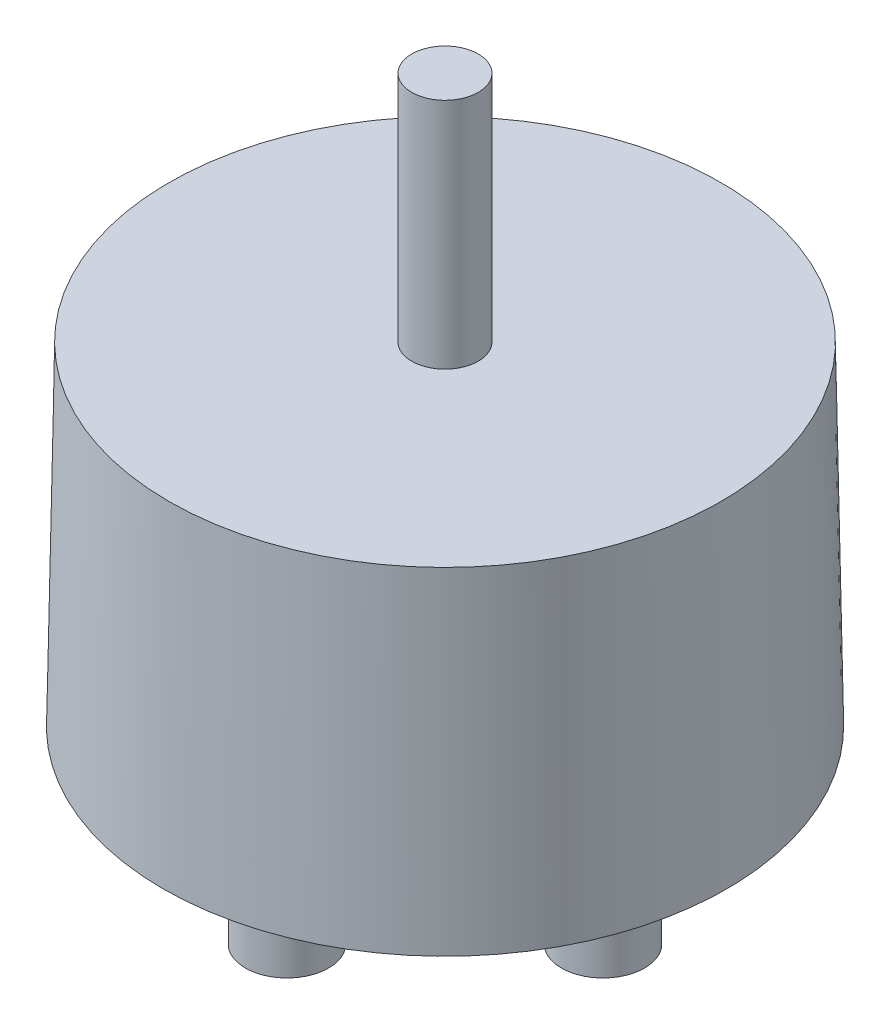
ISO-10303-21;
HEADER;
FILE_DESCRIPTION(('STEP AP214'),'2;1');
FILE_NAME('part.step','',(''),(''),'','','');
FILE_SCHEMA(('AUTOMOTIVE_DESIGN { 1 0 10303 214 1 1 1 1 }'));
ENDSEC;
DATA;
#1=APPLICATION_CONTEXT('core data for automotive mechanical design processes');
#2=APPLICATION_PROTOCOL_DEFINITION('international standard','automotive_design',2000,#1);
#3=PRODUCT_CONTEXT('',#1,'mechanical');
#4=PRODUCT('Part','Part','',(#3));
#5=PRODUCT_RELATED_PRODUCT_CATEGORY('part','',(#4));
#6=PRODUCT_DEFINITION_FORMATION('','',#4);
#7=PRODUCT_DEFINITION_CONTEXT('part definition',#1,'design');
#8=PRODUCT_DEFINITION('design','',#6,#7);
#9=PRODUCT_DEFINITION_SHAPE('','',#8);
#10=(LENGTH_UNIT() NAMED_UNIT(*) SI_UNIT(.MILLI.,.METRE.));
#11=(NAMED_UNIT(*) PLANE_ANGLE_UNIT() SI_UNIT($,.RADIAN.));
#12=(NAMED_UNIT(*) SI_UNIT($,.STERADIAN.) SOLID_ANGLE_UNIT());
#13=UNCERTAINTY_MEASURE_WITH_UNIT(LENGTH_MEASURE(1.E-05),#10,'distance_accuracy_value','');
#14=(GEOMETRIC_REPRESENTATION_CONTEXT(3) GLOBAL_UNCERTAINTY_ASSIGNED_CONTEXT((#13)) GLOBAL_UNIT_ASSIGNED_CONTEXT((#10,
#11,#12)) REPRESENTATION_CONTEXT('',''));
#15=CARTESIAN_POINT('',(0.,0.,0.));
#16=DIRECTION('',(0.,0.,1.));
#17=DIRECTION('',(1.,0.,0.));
#18=AXIS2_PLACEMENT_3D('',#15,#16,#17);
#19=CARTESIAN_POINT('',(-3.89473684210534,0.,8.64473684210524));
#20=DIRECTION('',(0.,-1.,0.));
#21=DIRECTION('',(0.,0.,-1.));
#22=AXIS2_PLACEMENT_3D('',#19,#20,#21);
#23=PLANE('',#22);
#24=CARTESIAN_POINT('',(0.,0.,9.5));
#25=DIRECTION('',(0.,1.,0.));
#26=DIRECTION('',(0.,0.,1.));
#27=AXIS2_PLACEMENT_3D('',#24,#25,#26);
#28=CIRCLE('',#27,1.5);
#29=CARTESIAN_POINT('',(0.,0.,11.));
#30=VERTEX_POINT('',#29);
#31=EDGE_CURVE('E195',#30,#30,#28,.T.);
#32=ORIENTED_EDGE('',*,*,#31,.T.);
#33=EDGE_LOOP('',(#32));
#34=FACE_BOUND('',#33,.T.);
#35=CARTESIAN_POINT('',(0.,0.,-9.5));
#36=DIRECTION('',(0.,1.,0.));
#37=DIRECTION('',(0.,0.,1.));
#38=AXIS2_PLACEMENT_3D('',#35,#36,#37);
#39=CIRCLE('',#38,1.5);
#40=CARTESIAN_POINT('',(0.,0.,-8.));
#41=VERTEX_POINT('',#40);
#42=EDGE_CURVE('E152',#41,#41,#39,.T.);
#43=ORIENTED_EDGE('',*,*,#42,.T.);
#44=EDGE_LOOP('',(#43));
#45=FACE_BOUND('',#44,.T.);
#46=CARTESIAN_POINT('',(-7.78947368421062,0.,7.78947368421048));
#47=DIRECTION('',(0.,-1.,0.));
#48=DIRECTION('',(0.,0.,-1.));
#49=AXIS2_PLACEMENT_3D('',#46,#47,#48);
#50=CIRCLE('',#49,5.96626230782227);
#51=CARTESIAN_POINT('',(-7.78947368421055,0.,1.82321137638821));
#52=VERTEX_POINT('',#51);
#53=CARTESIAN_POINT('',(-1.82321137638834,0.,7.78947368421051));
#54=VERTEX_POINT('',#53);
#55=EDGE_CURVE('E148',#52,#54,#50,.T.);
#56=ORIENTED_EDGE('',*,*,#55,.F.);
#57=CARTESIAN_POINT('',(-9.5,0.,0.));
#58=DIRECTION('',(0.,1.,0.));
#59=DIRECTION('',(0.,0.,1.));
#60=AXIS2_PLACEMENT_3D('',#57,#58,#59);
#61=CIRCLE('',#60,2.5);
#62=CARTESIAN_POINT('',(-7.78947368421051,0.,-1.82321137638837));
#63=VERTEX_POINT('',#62);
#64=EDGE_CURVE('E90',#63,#52,#61,.T.);
#65=ORIENTED_EDGE('',*,*,#64,.F.);
#66=CARTESIAN_POINT('',(-7.78947368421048,0.,-7.78947368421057));
#67=DIRECTION('',(0.,-1.,0.));
#68=DIRECTION('',(0.,0.,-1.));
#69=AXIS2_PLACEMENT_3D('',#66,#67,#68);
#70=CIRCLE('',#69,5.9662623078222);
#71=CARTESIAN_POINT('',(-1.82321137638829,0.,-7.78947368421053));
#72=VERTEX_POINT('',#71);
#73=EDGE_CURVE('E84',#72,#63,#70,.T.);
#74=ORIENTED_EDGE('',*,*,#73,.F.);
#75=CARTESIAN_POINT('',(0.,0.,-9.5));
#76=DIRECTION('',(0.,1.,0.));
#77=DIRECTION('',(0.,0.,1.));
#78=AXIS2_PLACEMENT_3D('',#75,#76,#77);
#79=CIRCLE('',#78,2.5);
#80=CARTESIAN_POINT('',(1.82321137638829,0.,-7.78947368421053));
#81=VERTEX_POINT('',#80);
#82=EDGE_CURVE('E159',#81,#72,#79,.T.);
#83=ORIENTED_EDGE('',*,*,#82,.F.);
#84=CARTESIAN_POINT('',(7.78947368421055,0.,-7.78947368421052));
#85=DIRECTION('',(0.,-1.,0.));
#86=DIRECTION('',(0.,0.,-1.));
#87=AXIS2_PLACEMENT_3D('',#84,#85,#86);
#88=CIRCLE('',#87,5.96626230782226);
#89=CARTESIAN_POINT('',(7.78947368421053,0.,-1.82321137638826));
#90=VERTEX_POINT('',#89);
#91=EDGE_CURVE('E120',#90,#81,#88,.T.);
#92=ORIENTED_EDGE('',*,*,#91,.F.);
#93=CARTESIAN_POINT('',(9.5,0.,0.));
#94=DIRECTION('',(0.,1.,0.));
#95=DIRECTION('',(0.,0.,1.));
#96=AXIS2_PLACEMENT_3D('',#93,#94,#95);
#97=CIRCLE('',#96,2.5);
#98=CARTESIAN_POINT('',(7.78947368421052,0.,1.82321137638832));
#99=VERTEX_POINT('',#98);
#100=EDGE_CURVE('E156',#99,#90,#97,.T.);
#101=ORIENTED_EDGE('',*,*,#100,.F.);
#102=CARTESIAN_POINT('',(7.78947368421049,0.,7.78947368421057));
#103=DIRECTION('',(0.,-1.,0.));
#104=DIRECTION('',(0.,0.,-1.));
#105=AXIS2_PLACEMENT_3D('',#102,#103,#104);
#106=CIRCLE('',#105,5.96626230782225);
#107=CARTESIAN_POINT('',(1.82321137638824,0.,7.78947368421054));
#108=VERTEX_POINT('',#107);
#109=EDGE_CURVE('E154',#108,#99,#106,.T.);
#110=ORIENTED_EDGE('',*,*,#109,.F.);
#111=CARTESIAN_POINT('',(0.,0.,9.5));
#112=DIRECTION('',(0.,1.,0.));
#113=DIRECTION('',(0.,0.,1.));
#114=AXIS2_PLACEMENT_3D('',#111,#112,#113);
#115=CIRCLE('',#114,2.5);
#116=EDGE_CURVE('E151',#54,#108,#115,.T.);
#117=ORIENTED_EDGE('',*,*,#116,.F.);
#118=EDGE_LOOP('',(#56,#65,#74,#83,#92,#101,#110,#117));
#119=FACE_BOUND('',#118,.T.);
#120=CARTESIAN_POINT('',(9.5,0.,0.));
#121=DIRECTION('',(0.,1.,0.));
#122=DIRECTION('',(0.,0.,1.));
#123=AXIS2_PLACEMENT_3D('',#120,#121,#122);
#124=CIRCLE('',#123,1.5);
#125=CARTESIAN_POINT('',(9.5,0.,1.50000000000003));
#126=VERTEX_POINT('',#125);
#127=EDGE_CURVE('E187',#126,#126,#124,.T.);
#128=ORIENTED_EDGE('',*,*,#127,.T.);
#129=EDGE_LOOP('',(#128));
#130=FACE_BOUND('',#129,.T.);
#131=CARTESIAN_POINT('',(-9.5,0.,0.));
#132=DIRECTION('',(0.,1.,0.));
#133=DIRECTION('',(0.,0.,1.));
#134=AXIS2_PLACEMENT_3D('',#131,#132,#133);
#135=CIRCLE('',#134,1.5);
#136=CARTESIAN_POINT('',(-9.5,0.,1.4999999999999));
#137=VERTEX_POINT('',#136);
#138=EDGE_CURVE('E191',#137,#137,#135,.T.);
#139=ORIENTED_EDGE('',*,*,#138,.T.);
#140=EDGE_LOOP('',(#139));
#141=FACE_BOUND('',#140,.T.);
#142=ADVANCED_FACE('F39',(#34,#45,#119,#130,#141),#23,.T.);
#143=CARTESIAN_POINT('',(-7.78947368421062,6.6,7.78947368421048));
#144=DIRECTION('',(0.,-1.,0.));
#145=DIRECTION('',(0.,0.,-1.));
#146=AXIS2_PLACEMENT_3D('',#143,#144,#145);
#147=CYLINDRICAL_SURFACE('',#146,5.96626230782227);
#148=ORIENTED_EDGE('',*,*,#55,.T.);
#149=DIRECTION('',(0.,-1.,0.));
#150=VECTOR('',#149,1.);
#151=CARTESIAN_POINT('',(-1.82321137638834,6.6,7.78947368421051));
#152=LINE('',#151,#150);
#153=CARTESIAN_POINT('',(-1.82321137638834,6.6,7.78947368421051));
#154=VERTEX_POINT('',#153);
#155=EDGE_CURVE('E11',#154,#54,#152,.T.);
#156=ORIENTED_EDGE('',*,*,#155,.F.);
#157=CARTESIAN_POINT('',(-7.78947368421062,6.6,7.78947368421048));
#158=DIRECTION('',(0.,-1.,0.));
#159=DIRECTION('',(0.,0.,-1.));
#160=AXIS2_PLACEMENT_3D('',#157,#158,#159);
#161=CIRCLE('',#160,5.96626230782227);
#162=CARTESIAN_POINT('',(-7.78947368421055,6.6,1.82321137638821));
#163=VERTEX_POINT('',#162);
#164=EDGE_CURVE('E163',#163,#154,#161,.T.);
#165=ORIENTED_EDGE('',*,*,#164,.F.);
#166=DIRECTION('',(0.,-1.,0.));
#167=VECTOR('',#166,1.);
#168=CARTESIAN_POINT('',(-7.78947368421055,6.6,1.82321137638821));
#169=LINE('',#168,#167);
#170=EDGE_CURVE('E147',#163,#52,#169,.T.);
#171=ORIENTED_EDGE('',*,*,#170,.T.);
#172=EDGE_LOOP('',(#148,#156,#165,#171));
#173=FACE_BOUND('',#172,.T.);
#174=ADVANCED_FACE('F41',(#173),#147,.F.);
#175=CARTESIAN_POINT('',(0.,6.6,9.5));
#176=DIRECTION('',(0.,-1.,0.));
#177=DIRECTION('',(0.,0.,-1.));
#178=AXIS2_PLACEMENT_3D('',#175,#176,#177);
#179=CYLINDRICAL_SURFACE('',#178,2.5);
#180=ORIENTED_EDGE('',*,*,#116,.T.);
#181=DIRECTION('',(0.,-1.,0.));
#182=VECTOR('',#181,1.);
#183=CARTESIAN_POINT('',(1.82321137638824,6.6,7.78947368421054));
#184=LINE('',#183,#182);
#185=CARTESIAN_POINT('',(1.82321137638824,6.6,7.78947368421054));
#186=VERTEX_POINT('',#185);
#187=EDGE_CURVE('E48',#186,#108,#184,.T.);
#188=ORIENTED_EDGE('',*,*,#187,.F.);
#189=CARTESIAN_POINT('',(0.,6.6,9.5));
#190=DIRECTION('',(0.,1.,0.));
#191=DIRECTION('',(0.,0.,1.));
#192=AXIS2_PLACEMENT_3D('',#189,#190,#191);
#193=CIRCLE('',#192,2.5);
#194=EDGE_CURVE('E98',#154,#186,#193,.T.);
#195=ORIENTED_EDGE('',*,*,#194,.F.);
#196=ORIENTED_EDGE('',*,*,#155,.T.);
#197=EDGE_LOOP('',(#180,#188,#195,#196));
#198=FACE_BOUND('',#197,.T.);
#199=ADVANCED_FACE('F260',(#198),#179,.T.);
#200=CARTESIAN_POINT('',(7.78947368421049,6.6,7.78947368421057));
#201=DIRECTION('',(0.,-1.,0.));
#202=DIRECTION('',(0.,0.,-1.));
#203=AXIS2_PLACEMENT_3D('',#200,#201,#202);
#204=CYLINDRICAL_SURFACE('',#203,5.96626230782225);
#205=ORIENTED_EDGE('',*,*,#109,.T.);
#206=DIRECTION('',(0.,-1.,0.));
#207=VECTOR('',#206,1.);
#208=CARTESIAN_POINT('',(7.78947368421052,6.6,1.82321137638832));
#209=LINE('',#208,#207);
#210=CARTESIAN_POINT('',(7.78947368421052,6.6,1.82321137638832));
#211=VERTEX_POINT('',#210);
#212=EDGE_CURVE('E168',#211,#99,#209,.T.);
#213=ORIENTED_EDGE('',*,*,#212,.F.);
#214=CARTESIAN_POINT('',(7.78947368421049,6.6,7.78947368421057));
#215=DIRECTION('',(0.,-1.,0.));
#216=DIRECTION('',(0.,0.,-1.));
#217=AXIS2_PLACEMENT_3D('',#214,#215,#216);
#218=CIRCLE('',#217,5.96626230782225);
#219=EDGE_CURVE('E140',#186,#211,#218,.T.);
#220=ORIENTED_EDGE('',*,*,#219,.F.);
#221=ORIENTED_EDGE('',*,*,#187,.T.);
#222=EDGE_LOOP('',(#205,#213,#220,#221));
#223=FACE_BOUND('',#222,.T.);
#224=ADVANCED_FACE('F174',(#223),#204,.F.);
#225=CARTESIAN_POINT('',(9.5,6.6,0.));
#226=DIRECTION('',(0.,-1.,0.));
#227=DIRECTION('',(0.,0.,-1.));
#228=AXIS2_PLACEMENT_3D('',#225,#226,#227);
#229=CYLINDRICAL_SURFACE('',#228,2.5);
#230=ORIENTED_EDGE('',*,*,#100,.T.);
#231=DIRECTION('',(0.,-1.,0.));
#232=VECTOR('',#231,1.);
#233=CARTESIAN_POINT('',(7.78947368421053,6.6,-1.82321137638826));
#234=LINE('',#233,#232);
#235=CARTESIAN_POINT('',(7.78947368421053,6.6,-1.82321137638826));
#236=VERTEX_POINT('',#235);
#237=EDGE_CURVE('E123',#236,#90,#234,.T.);
#238=ORIENTED_EDGE('',*,*,#237,.F.);
#239=CARTESIAN_POINT('',(9.5,6.6,0.));
#240=DIRECTION('',(0.,1.,0.));
#241=DIRECTION('',(0.,0.,1.));
#242=AXIS2_PLACEMENT_3D('',#239,#240,#241);
#243=CIRCLE('',#242,2.5);
#244=EDGE_CURVE('E138',#211,#236,#243,.T.);
#245=ORIENTED_EDGE('',*,*,#244,.F.);
#246=ORIENTED_EDGE('',*,*,#212,.T.);
#247=EDGE_LOOP('',(#230,#238,#245,#246));
#248=FACE_BOUND('',#247,.T.);
#249=ADVANCED_FACE('F180',(#248),#229,.T.);
#250=CARTESIAN_POINT('',(7.78947368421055,6.6,-7.78947368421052));
#251=DIRECTION('',(0.,-1.,0.));
#252=DIRECTION('',(0.,0.,-1.));
#253=AXIS2_PLACEMENT_3D('',#250,#251,#252);
#254=CYLINDRICAL_SURFACE('',#253,5.96626230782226);
#255=ORIENTED_EDGE('',*,*,#91,.T.);
#256=DIRECTION('',(0.,-1.,0.));
#257=VECTOR('',#256,1.);
#258=CARTESIAN_POINT('',(1.82321137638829,6.6,-7.78947368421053));
#259=LINE('',#258,#257);
#260=CARTESIAN_POINT('',(1.82321137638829,6.6,-7.78947368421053));
#261=VERTEX_POINT('',#260);
#262=EDGE_CURVE('E112',#261,#81,#259,.T.);
#263=ORIENTED_EDGE('',*,*,#262,.F.);
#264=CARTESIAN_POINT('',(7.78947368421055,6.6,-7.78947368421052));
#265=DIRECTION('',(0.,-1.,0.));
#266=DIRECTION('',(0.,0.,-1.));
#267=AXIS2_PLACEMENT_3D('',#264,#265,#266);
#268=CIRCLE('',#267,5.96626230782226);
#269=EDGE_CURVE('E117',#236,#261,#268,.T.);
#270=ORIENTED_EDGE('',*,*,#269,.F.);
#271=ORIENTED_EDGE('',*,*,#237,.T.);
#272=EDGE_LOOP('',(#255,#263,#270,#271));
#273=FACE_BOUND('',#272,.T.);
#274=ADVANCED_FACE('F114',(#273),#254,.F.);
#275=CARTESIAN_POINT('',(0.,6.6,-9.5));
#276=DIRECTION('',(0.,-1.,0.));
#277=DIRECTION('',(0.,0.,-1.));
#278=AXIS2_PLACEMENT_3D('',#275,#276,#277);
#279=CYLINDRICAL_SURFACE('',#278,2.5);
#280=ORIENTED_EDGE('',*,*,#82,.T.);
#281=DIRECTION('',(0.,-1.,0.));
#282=VECTOR('',#281,1.);
#283=CARTESIAN_POINT('',(-1.82321137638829,6.6,-7.78947368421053));
#284=LINE('',#283,#282);
#285=CARTESIAN_POINT('',(-1.82321137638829,6.6,-7.78947368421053));
#286=VERTEX_POINT('',#285);
#287=EDGE_CURVE('E124',#286,#72,#284,.T.);
#288=ORIENTED_EDGE('',*,*,#287,.F.);
#289=CARTESIAN_POINT('',(0.,6.6,-9.5));
#290=DIRECTION('',(0.,1.,0.));
#291=DIRECTION('',(0.,0.,1.));
#292=AXIS2_PLACEMENT_3D('',#289,#290,#291);
#293=CIRCLE('',#292,2.5);
#294=EDGE_CURVE('E127',#261,#286,#293,.T.);
#295=ORIENTED_EDGE('',*,*,#294,.F.);
#296=ORIENTED_EDGE('',*,*,#262,.T.);
#297=EDGE_LOOP('',(#280,#288,#295,#296));
#298=FACE_BOUND('',#297,.T.);
#299=ADVANCED_FACE('F128',(#298),#279,.T.);
#300=CARTESIAN_POINT('',(-7.78947368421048,6.6,-7.78947368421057));
#301=DIRECTION('',(0.,-1.,0.));
#302=DIRECTION('',(0.,0.,-1.));
#303=AXIS2_PLACEMENT_3D('',#300,#301,#302);
#304=CYLINDRICAL_SURFACE('',#303,5.9662623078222);
#305=ORIENTED_EDGE('',*,*,#73,.T.);
#306=DIRECTION('',(0.,-1.,0.));
#307=VECTOR('',#306,1.);
#308=CARTESIAN_POINT('',(-7.78947368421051,6.6,-1.82321137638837));
#309=LINE('',#308,#307);
#310=CARTESIAN_POINT('',(-7.78947368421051,6.6,-1.82321137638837));
#311=VERTEX_POINT('',#310);
#312=EDGE_CURVE('E56',#311,#63,#309,.T.);
#313=ORIENTED_EDGE('',*,*,#312,.F.);
#314=CARTESIAN_POINT('',(-7.78947368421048,6.6,-7.78947368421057));
#315=DIRECTION('',(0.,-1.,0.));
#316=DIRECTION('',(0.,0.,-1.));
#317=AXIS2_PLACEMENT_3D('',#314,#315,#316);
#318=CIRCLE('',#317,5.9662623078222);
#319=EDGE_CURVE('E131',#286,#311,#318,.T.);
#320=ORIENTED_EDGE('',*,*,#319,.F.);
#321=ORIENTED_EDGE('',*,*,#287,.T.);
#322=EDGE_LOOP('',(#305,#313,#320,#321));
#323=FACE_BOUND('',#322,.T.);
#324=ADVANCED_FACE('F270',(#323),#304,.F.);
#325=CARTESIAN_POINT('',(-9.5,6.6,0.));
#326=DIRECTION('',(0.,-1.,0.));
#327=DIRECTION('',(0.,0.,-1.));
#328=AXIS2_PLACEMENT_3D('',#325,#326,#327);
#329=CYLINDRICAL_SURFACE('',#328,2.5);
#330=ORIENTED_EDGE('',*,*,#64,.T.);
#331=ORIENTED_EDGE('',*,*,#170,.F.);
#332=CARTESIAN_POINT('',(-9.5,6.6,0.));
#333=DIRECTION('',(0.,1.,0.));
#334=DIRECTION('',(0.,0.,1.));
#335=AXIS2_PLACEMENT_3D('',#332,#333,#334);
#336=CIRCLE('',#335,2.5);
#337=EDGE_CURVE('E145',#311,#163,#336,.T.);
#338=ORIENTED_EDGE('',*,*,#337,.F.);
#339=ORIENTED_EDGE('',*,*,#312,.T.);
#340=EDGE_LOOP('',(#330,#331,#338,#339));
#341=FACE_BOUND('',#340,.T.);
#342=ADVANCED_FACE('F267',(#341),#329,.T.);
#343=CARTESIAN_POINT('',(0.,6.6,-9.5));
#344=DIRECTION('',(0.,-1.,0.));
#345=DIRECTION('',(0.,0.,-1.));
#346=AXIS2_PLACEMENT_3D('',#343,#344,#345);
#347=CYLINDRICAL_SURFACE('',#346,1.5);
#348=CARTESIAN_POINT('',(0.,6.6,-9.5));
#349=DIRECTION('',(0.,1.,0.));
#350=DIRECTION('',(0.,0.,1.));
#351=AXIS2_PLACEMENT_3D('',#348,#349,#350);
#352=CIRCLE('',#351,1.5);
#353=CARTESIAN_POINT('',(0.,6.6,-8.));
#354=VERTEX_POINT('',#353);
#355=EDGE_CURVE('E188',#354,#354,#352,.T.);
#356=ORIENTED_EDGE('',*,*,#355,.T.);
#357=EDGE_LOOP('',(#356));
#358=FACE_BOUND('',#357,.T.);
#359=ORIENTED_EDGE('',*,*,#42,.F.);
#360=EDGE_LOOP('',(#359));
#361=FACE_BOUND('',#360,.T.);
#362=ADVANCED_FACE('F265',(#358,#361),#347,.F.);
#363=CARTESIAN_POINT('',(9.5,6.6,0.));
#364=DIRECTION('',(0.,-1.,0.));
#365=DIRECTION('',(0.,0.,-1.));
#366=AXIS2_PLACEMENT_3D('',#363,#364,#365);
#367=CYLINDRICAL_SURFACE('',#366,1.5);
#368=CARTESIAN_POINT('',(9.5,6.6,0.));
#369=DIRECTION('',(0.,1.,0.));
#370=DIRECTION('',(0.,0.,1.));
#371=AXIS2_PLACEMENT_3D('',#368,#369,#370);
#372=CIRCLE('',#371,1.5);
#373=CARTESIAN_POINT('',(9.5,6.6,1.50000000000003));
#374=VERTEX_POINT('',#373);
#375=EDGE_CURVE('E192',#374,#374,#372,.T.);
#376=ORIENTED_EDGE('',*,*,#375,.T.);
#377=EDGE_LOOP('',(#376));
#378=FACE_BOUND('',#377,.T.);
#379=ORIENTED_EDGE('',*,*,#127,.F.);
#380=EDGE_LOOP('',(#379));
#381=FACE_BOUND('',#380,.T.);
#382=ADVANCED_FACE('F392',(#378,#381),#367,.F.);
#383=CARTESIAN_POINT('',(0.,6.6,9.5));
#384=DIRECTION('',(0.,-1.,0.));
#385=DIRECTION('',(0.,0.,-1.));
#386=AXIS2_PLACEMENT_3D('',#383,#384,#385);
#387=CYLINDRICAL_SURFACE('',#386,1.5);
#388=CARTESIAN_POINT('',(0.,6.6,9.5));
#389=DIRECTION('',(0.,1.,0.));
#390=DIRECTION('',(0.,0.,1.));
#391=AXIS2_PLACEMENT_3D('',#388,#389,#390);
#392=CIRCLE('',#391,1.5);
#393=CARTESIAN_POINT('',(0.,6.6,11.));
#394=VERTEX_POINT('',#393);
#395=EDGE_CURVE('E198',#394,#394,#392,.T.);
#396=ORIENTED_EDGE('',*,*,#395,.T.);
#397=EDGE_LOOP('',(#396));
#398=FACE_BOUND('',#397,.T.);
#399=ORIENTED_EDGE('',*,*,#31,.F.);
#400=EDGE_LOOP('',(#399));
#401=FACE_BOUND('',#400,.T.);
#402=ADVANCED_FACE('F383',(#398,#401),#387,.F.);
#403=CARTESIAN_POINT('',(-9.5,6.6,0.));
#404=DIRECTION('',(0.,-1.,0.));
#405=DIRECTION('',(0.,0.,-1.));
#406=AXIS2_PLACEMENT_3D('',#403,#404,#405);
#407=CYLINDRICAL_SURFACE('',#406,1.5);
#408=CARTESIAN_POINT('',(-9.5,6.6,0.));
#409=DIRECTION('',(0.,1.,0.));
#410=DIRECTION('',(0.,0.,1.));
#411=AXIS2_PLACEMENT_3D('',#408,#409,#410);
#412=CIRCLE('',#411,1.5);
#413=CARTESIAN_POINT('',(-9.5,6.6,1.4999999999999));
#414=VERTEX_POINT('',#413);
#415=EDGE_CURVE('E203',#414,#414,#412,.T.);
#416=ORIENTED_EDGE('',*,*,#415,.T.);
#417=EDGE_LOOP('',(#416));
#418=FACE_BOUND('',#417,.T.);
#419=ORIENTED_EDGE('',*,*,#138,.F.);
#420=EDGE_LOOP('',(#419));
#421=FACE_BOUND('',#420,.T.);
#422=ADVANCED_FACE('F251',(#418,#421),#407,.F.);
#423=CARTESIAN_POINT('',(0.,6.6,0.));
#424=DIRECTION('',(0.,1.,0.));
#425=DIRECTION('',(0.,0.,1.));
#426=AXIS2_PLACEMENT_3D('',#423,#424,#425);
#427=PLANE('',#426);
#428=ORIENTED_EDGE('',*,*,#415,.F.);
#429=EDGE_LOOP('',(#428));
#430=FACE_BOUND('',#429,.T.);
#431=ADVANCED_FACE('F243',(#430),#427,.F.);
#432=ORIENTED_EDGE('',*,*,#395,.F.);
#433=EDGE_LOOP('',(#432));
#434=FACE_BOUND('',#433,.T.);
#435=ADVANCED_FACE('F250',(#434),#427,.F.);
#436=ORIENTED_EDGE('',*,*,#375,.F.);
#437=EDGE_LOOP('',(#436));
#438=FACE_BOUND('',#437,.T.);
#439=ADVANCED_FACE('F247',(#438),#427,.F.);
#440=ORIENTED_EDGE('',*,*,#355,.F.);
#441=EDGE_LOOP('',(#440));
#442=FACE_BOUND('',#441,.T.);
#443=ADVANCED_FACE('F238',(#442),#427,.F.);
#444=CARTESIAN_POINT('',(0.,6.6,0.));
#445=DIRECTION('',(0.,-1.,0.));
#446=DIRECTION('',(0.,0.,1.));
#447=AXIS2_PLACEMENT_3D('',#444,#445,#446);
#448=CONICAL_SURFACE('',#447,16.95,0.0174532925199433);
#449=CARTESIAN_POINT('',(0.,26.6,0.));
#450=DIRECTION('',(0.,1.,0.));
#451=DIRECTION('',(0.,0.,1.));
#452=AXIS2_PLACEMENT_3D('',#449,#450,#451);
#453=CIRCLE('',#452,16.6008987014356);
#454=CARTESIAN_POINT('',(0.,26.6,16.6008987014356));
#455=VERTEX_POINT('',#454);
#456=EDGE_CURVE('E208',#455,#455,#453,.T.);
#457=ORIENTED_EDGE('',*,*,#456,.F.);
#458=EDGE_LOOP('',(#457));
#459=FACE_BOUND('',#458,.T.);
#460=CARTESIAN_POINT('',(0.,6.6,0.));
#461=DIRECTION('',(0.,1.,0.));
#462=DIRECTION('',(0.,0.,1.));
#463=AXIS2_PLACEMENT_3D('',#460,#461,#462);
#464=CIRCLE('',#463,16.95);
#465=CARTESIAN_POINT('',(0.,6.6,16.95));
#466=VERTEX_POINT('',#465);
#467=EDGE_CURVE('E211',#466,#466,#464,.T.);
#468=ORIENTED_EDGE('',*,*,#467,.T.);
#469=EDGE_LOOP('',(#468));
#470=FACE_BOUND('',#469,.T.);
#471=ADVANCED_FACE('F232',(#459,#470),#448,.T.);
#472=CARTESIAN_POINT('',(0.,26.6,0.));
#473=DIRECTION('',(0.,1.,0.));
#474=DIRECTION('',(0.,0.,1.));
#475=AXIS2_PLACEMENT_3D('',#472,#473,#474);
#476=PLANE('',#475);
#477=CARTESIAN_POINT('',(0.,26.6,0.));
#478=DIRECTION('',(0.,1.,0.));
#479=DIRECTION('',(0.,0.,1.));
#480=AXIS2_PLACEMENT_3D('',#477,#478,#479);
#481=CIRCLE('',#480,2.);
#482=CARTESIAN_POINT('',(0.,26.6,2.));
#483=VERTEX_POINT('',#482);
#484=EDGE_CURVE('E215',#483,#483,#481,.T.);
#485=ORIENTED_EDGE('',*,*,#484,.F.);
#486=EDGE_LOOP('',(#485));
#487=FACE_BOUND('',#486,.T.);
#488=ORIENTED_EDGE('',*,*,#456,.T.);
#489=EDGE_LOOP('',(#488));
#490=FACE_BOUND('',#489,.T.);
#491=ADVANCED_FACE('F229',(#487,#490),#476,.T.);
#492=ORIENTED_EDGE('',*,*,#337,.T.);
#493=ORIENTED_EDGE('',*,*,#164,.T.);
#494=ORIENTED_EDGE('',*,*,#194,.T.);
#495=ORIENTED_EDGE('',*,*,#219,.T.);
#496=ORIENTED_EDGE('',*,*,#244,.T.);
#497=ORIENTED_EDGE('',*,*,#269,.T.);
#498=ORIENTED_EDGE('',*,*,#294,.T.);
#499=ORIENTED_EDGE('',*,*,#319,.T.);
#500=EDGE_LOOP('',(#492,#493,#494,#495,#496,#497,#498,#499));
#501=FACE_BOUND('',#500,.T.);
#502=ORIENTED_EDGE('',*,*,#467,.F.);
#503=EDGE_LOOP('',(#502));
#504=FACE_BOUND('',#503,.T.);
#505=ADVANCED_FACE('F134',(#501,#504),#427,.F.);
#506=CARTESIAN_POINT('',(0.,40.6,0.));
#507=DIRECTION('',(0.,-1.,0.));
#508=DIRECTION('',(0.,0.,-1.));
#509=AXIS2_PLACEMENT_3D('',#506,#507,#508);
#510=CYLINDRICAL_SURFACE('',#509,2.);
#511=CARTESIAN_POINT('',(0.,40.6,0.));
#512=DIRECTION('',(0.,1.,0.));
#513=DIRECTION('',(0.,0.,1.));
#514=AXIS2_PLACEMENT_3D('',#511,#512,#513);
#515=CIRCLE('',#514,2.);
#516=CARTESIAN_POINT('',(0.,40.6,2.));
#517=VERTEX_POINT('',#516);
#518=EDGE_CURVE('E214',#517,#517,#515,.T.);
#519=ORIENTED_EDGE('',*,*,#518,.F.);
#520=EDGE_LOOP('',(#519));
#521=FACE_BOUND('',#520,.T.);
#522=ORIENTED_EDGE('',*,*,#484,.T.);
#523=EDGE_LOOP('',(#522));
#524=FACE_BOUND('',#523,.T.);
#525=ADVANCED_FACE('F223',(#521,#524),#510,.T.);
#526=CARTESIAN_POINT('',(0.,40.6,0.));
#527=DIRECTION('',(0.,1.,0.));
#528=DIRECTION('',(0.,0.,1.));
#529=AXIS2_PLACEMENT_3D('',#526,#527,#528);
#530=PLANE('',#529);
#531=ORIENTED_EDGE('',*,*,#518,.T.);
#532=EDGE_LOOP('',(#531));
#533=FACE_BOUND('',#532,.T.);
#534=ADVANCED_FACE('F221',(#533),#530,.T.);
#535=CLOSED_SHELL('',(#142,#174,#199,#224,#249,#274,#299,#324,#342,#362,#382,#402,#422,#431,
#435,#439,#443,#471,#491,#505,#525,#534));
#536=MANIFOLD_SOLID_BREP('B2',#535);
#537=ADVANCED_BREP_SHAPE_REPRESENTATION('',(#18,#536),#14);
#538=SHAPE_DEFINITION_REPRESENTATION(#9,#537);
ENDSEC;
END-ISO-10303-21;
